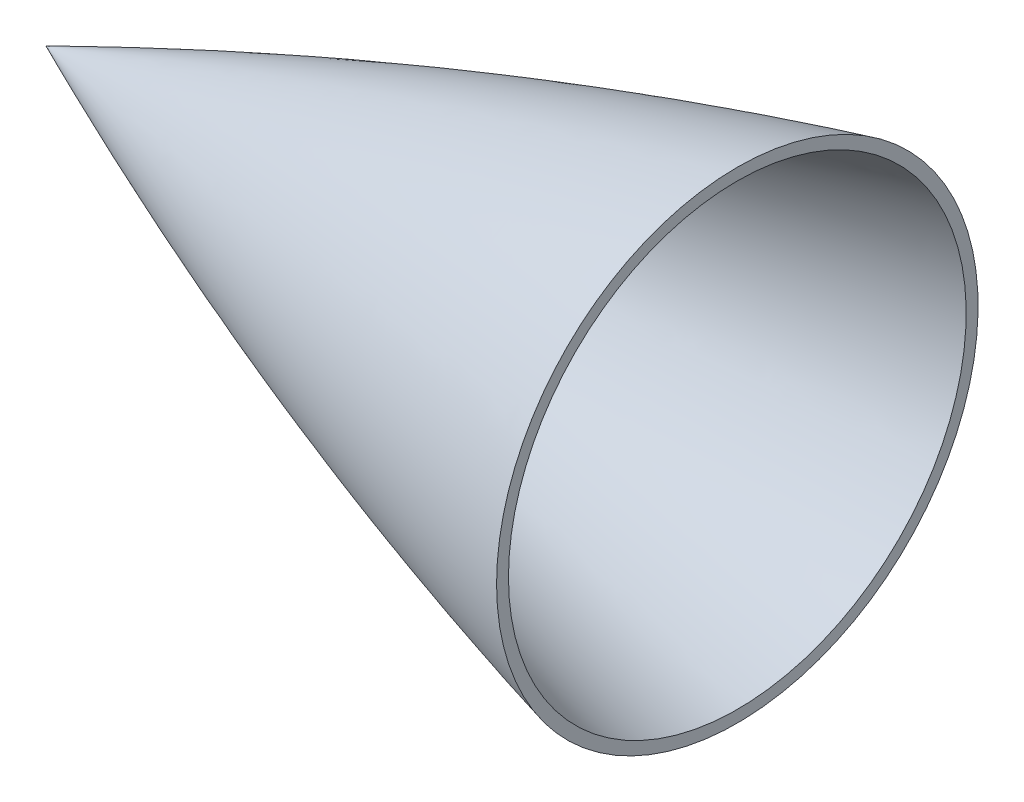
from build123d import *


with BuildPart() as part:
    # Sketch1 → Revolve5 (revolve)
    with BuildSketch(Plane.XY):
        with BuildLine():
            Line((762, 265.376558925), (762, 252.263848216))
            add(Edge.make_bspline(
                [(762, 252.263848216), (513.217700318, 188.233426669), (269.267235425, 103.375202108), (31.633506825, 0)],
                knots=[0.587558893, 0.587558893, 0.587558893, 0.587558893, 1, 1, 1, 1], degree=3))
            Line((31.633506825, 0), (0, 0))
            add(Edge.make_bspline(
                [(762, 265.376558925), (502.154651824, 198.69379799), (247.594377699, 109.358117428), (0, 0)],
                knots=[0.576959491, 0.576959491, 0.576959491, 0.576959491, 1, 1, 1, 1], degree=3))
        make_face()
    revolve(axis=Axis((0, 0, 0), (1, 0, 0)))


solid = part.part
